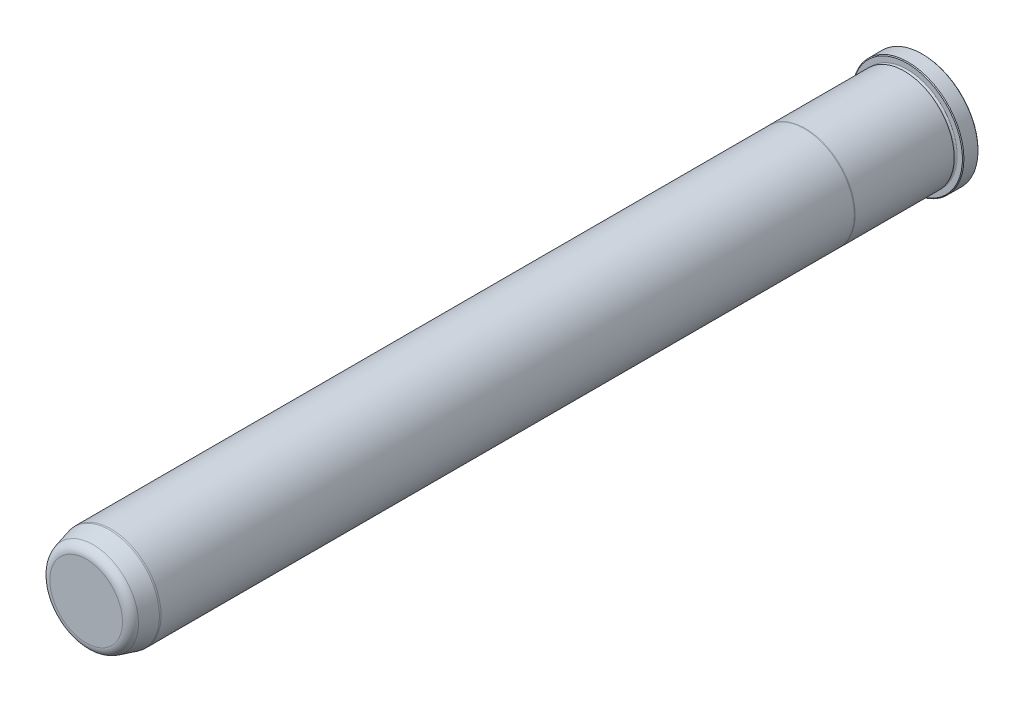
from build123d import *

# Parameters (mm, degrees)
FILLET6_R     = 4.7625
CHAMFER1_SIZE = 0.381


with BuildPart() as part:
    # Sketch1 → Revolve1 (revolve)
    with BuildSketch(Plane(origin=(0, 0, 0), x_dir=(0, 0, -1), z_dir=(1, 0, 0)), mode=Mode.PRIVATE) as revolve1_sk:
        with BuildLine():
            Line((0, 0), (0, 28.448))
            Line((0, 28.448), (-7.9248, 28.448))
            Line((-7.9248, 28.448), (-7.9248, 25.3873))
            ThreePointArc((-7.9248, 25.3873), (-8.6868, 24.6253), (-9.4488, 25.3873))
            Line((-9.4488, 25.3873), (-9.4488, 25.4127))
            Line((-9.4488, 25.4127), (-59.834763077, 25.4127))
            Line((-59.834763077, 25.4127), (-60.198, 25.3873))
            Line((-60.198, 25.3873), (-412.75, 25.3873))
            Line((-412.75, 25.3873), (-413.512, 25.320633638))
            Line((-413.512, 25.320633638), (-425.45, 22.121856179))
            Line((-425.45, 22.121856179), (-425.45, 0))
            Line((-425.45, 0), (0, 0))
        make_face()
    revolve(revolve1_sk.sketch.rotate(Axis((0, 0, 0), (0, 0, -1)), 90), axis=Axis((0, 0, 0), (0, 0, -1)))

    # Fillet6
    fillet6_edges = [part.edges().sort_by_distance(p)[0] for p in [
        (-22.121856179, 0, 425.45),
    ]]
    fillet(fillet6_edges, radius=FILLET6_R)

    # Chamfer1
    chamfer1_edges = [part.edges().sort_by_distance(p)[0] for p in [
        (-28.448, 0, 7.9248),
        (-28.448, 0, 0),
    ]]
    chamfer(chamfer1_edges, length=CHAMFER1_SIZE)


solid = part.part
